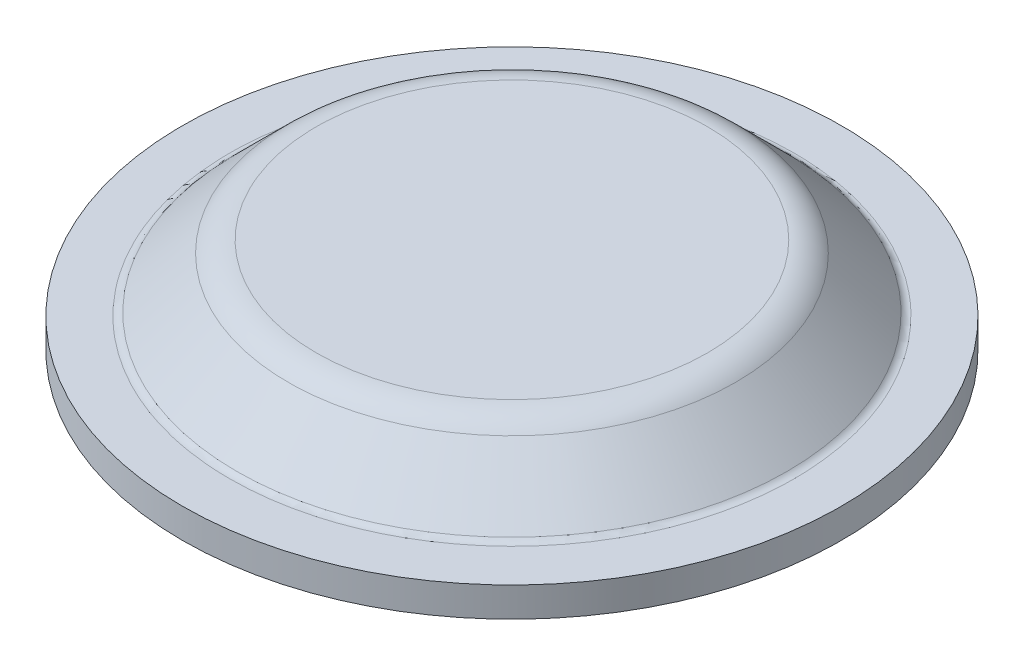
ISO-10303-21;
HEADER;
FILE_DESCRIPTION(('STEP AP214'),'2;1');
FILE_NAME('part.step','',(''),(''),'','','');
FILE_SCHEMA(('AUTOMOTIVE_DESIGN { 1 0 10303 214 1 1 1 1 }'));
ENDSEC;
DATA;
#1=APPLICATION_CONTEXT('core data for automotive mechanical design processes');
#2=APPLICATION_PROTOCOL_DEFINITION('international standard','automotive_design',2000,#1);
#3=PRODUCT_CONTEXT('',#1,'mechanical');
#4=PRODUCT('Part','Part','',(#3));
#5=PRODUCT_RELATED_PRODUCT_CATEGORY('part','',(#4));
#6=PRODUCT_DEFINITION_FORMATION('','',#4);
#7=PRODUCT_DEFINITION_CONTEXT('part definition',#1,'design');
#8=PRODUCT_DEFINITION('design','',#6,#7);
#9=PRODUCT_DEFINITION_SHAPE('','',#8);
#10=(LENGTH_UNIT() NAMED_UNIT(*) SI_UNIT(.MILLI.,.METRE.));
#11=(NAMED_UNIT(*) PLANE_ANGLE_UNIT() SI_UNIT($,.RADIAN.));
#12=(NAMED_UNIT(*) SI_UNIT($,.STERADIAN.) SOLID_ANGLE_UNIT());
#13=UNCERTAINTY_MEASURE_WITH_UNIT(LENGTH_MEASURE(1.E-05),#10,'distance_accuracy_value','');
#14=(GEOMETRIC_REPRESENTATION_CONTEXT(3) GLOBAL_UNCERTAINTY_ASSIGNED_CONTEXT((#13)) GLOBAL_UNIT_ASSIGNED_CONTEXT((#10,
#11,#12)) REPRESENTATION_CONTEXT('',''));
#15=CARTESIAN_POINT('',(0.,0.,0.));
#16=DIRECTION('',(0.,0.,1.));
#17=DIRECTION('',(1.,0.,0.));
#18=AXIS2_PLACEMENT_3D('',#15,#16,#17);
#19=CARTESIAN_POINT('',(0.,-2.286,0.));
#20=DIRECTION('',(0.,1.,0.));
#21=DIRECTION('',(0.,0.,1.));
#22=AXIS2_PLACEMENT_3D('',#19,#20,#21);
#23=PLANE('',#22);
#24=CARTESIAN_POINT('',(0.,-2.286,0.));
#25=DIRECTION('',(0.,1.,0.));
#26=DIRECTION('',(0.,0.,1.));
#27=AXIS2_PLACEMENT_3D('',#24,#25,#26);
#28=CIRCLE('',#27,15.0876);
#29=CARTESIAN_POINT('',(0.,-2.286,15.0876));
#30=VERTEX_POINT('',#29);
#31=EDGE_CURVE('E22',#30,#30,#28,.F.);
#32=ORIENTED_EDGE('',*,*,#31,.T.);
#33=EDGE_LOOP('',(#32));
#34=FACE_BOUND('',#33,.T.);
#35=ADVANCED_FACE('F17',(#34),#23,.F.);
#36=CARTESIAN_POINT('',(0.,-3.048,0.));
#37=DIRECTION('',(0.,1.,0.));
#38=DIRECTION('',(0.,0.,1.));
#39=AXIS2_PLACEMENT_3D('',#36,#37,#38);
#40=TOROIDAL_SURFACE('',#39,15.0876,0.761999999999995);
#41=ORIENTED_EDGE('',*,*,#31,.F.);
#42=EDGE_LOOP('',(#41));
#43=FACE_BOUND('',#42,.T.);
#44=CARTESIAN_POINT('',(0.,-2.50918463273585,0.));
#45=DIRECTION('',(0.,-1.,0.));
#46=DIRECTION('',(1.,0.,0.));
#47=AXIS2_PLACEMENT_3D('',#44,#45,#46);
#48=CIRCLE('',#47,15.6264153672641);
#49=CARTESIAN_POINT('',(15.6264153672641,-2.50918463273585,0.));
#50=VERTEX_POINT('',#49);
#51=EDGE_CURVE('E125',#50,#50,#48,.T.);
#52=ORIENTED_EDGE('',*,*,#51,.T.);
#53=EDGE_LOOP('',(#52));
#54=FACE_BOUND('',#53,.T.);
#55=ADVANCED_FACE('F85',(#43,#54),#40,.F.);
#56=CARTESIAN_POINT('',(0.,-6.47326146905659,0.));
#57=DIRECTION('',(0.,-1.,0.));
#58=DIRECTION('',(1.,0.,0.));
#59=AXIS2_PLACEMENT_3D('',#56,#57,#58);
#60=CONICAL_SURFACE('',#59,19.5904922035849,0.785398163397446);
#61=ORIENTED_EDGE('',*,*,#51,.F.);
#62=EDGE_LOOP('',(#61));
#63=FACE_BOUND('',#62,.T.);
#64=CARTESIAN_POINT('',(0.,-6.47326146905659,0.));
#65=DIRECTION('',(0.,1.,0.));
#66=DIRECTION('',(0.,0.,-1.));
#67=AXIS2_PLACEMENT_3D('',#64,#65,#66);
#68=CIRCLE('',#67,19.5904922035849);
#69=CARTESIAN_POINT('',(0.,-6.47326146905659,-19.5904922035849));
#70=VERTEX_POINT('',#69);
#71=EDGE_CURVE('E121',#70,#70,#68,.T.);
#72=ORIENTED_EDGE('',*,*,#71,.F.);
#73=EDGE_LOOP('',(#72));
#74=FACE_BOUND('',#73,.T.);
#75=ADVANCED_FACE('F82',(#63,#74),#60,.F.);
#76=CARTESIAN_POINT('',(0.,-4.31799999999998,0.));
#77=DIRECTION('',(0.,1.,0.));
#78=DIRECTION('',(0.,0.,1.));
#79=AXIS2_PLACEMENT_3D('',#76,#77,#78);
#80=TOROIDAL_SURFACE('',#79,21.7457536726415,3.04800000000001);
#81=ORIENTED_EDGE('',*,*,#71,.T.);
#82=EDGE_LOOP('',(#81));
#83=FACE_BOUND('',#82,.T.);
#84=CARTESIAN_POINT('',(0.,-7.366,0.));
#85=DIRECTION('',(0.,1.,0.));
#86=DIRECTION('',(0.,0.,1.));
#87=AXIS2_PLACEMENT_3D('',#84,#85,#86);
#88=CIRCLE('',#87,21.7457536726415);
#89=CARTESIAN_POINT('',(0.,-7.366,21.7457536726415));
#90=VERTEX_POINT('',#89);
#91=EDGE_CURVE('E119',#90,#90,#88,.F.);
#92=ORIENTED_EDGE('',*,*,#91,.T.);
#93=EDGE_LOOP('',(#92));
#94=FACE_BOUND('',#93,.T.);
#95=ADVANCED_FACE('F80',(#83,#94),#80,.T.);
#96=CARTESIAN_POINT('',(21.7457536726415,-7.366,0.));
#97=DIRECTION('',(0.,1.,0.));
#98=DIRECTION('',(0.,0.,1.));
#99=AXIS2_PLACEMENT_3D('',#96,#97,#98);
#100=PLANE('',#99);
#101=CARTESIAN_POINT('',(0.,-7.366,0.));
#102=DIRECTION('',(0.,1.,0.));
#103=DIRECTION('',(0.,0.,1.));
#104=AXIS2_PLACEMENT_3D('',#101,#102,#103);
#105=CIRCLE('',#104,25.4);
#106=CARTESIAN_POINT('',(0.,-7.366,25.4));
#107=VERTEX_POINT('',#106);
#108=EDGE_CURVE('E117',#107,#107,#105,.T.);
#109=ORIENTED_EDGE('',*,*,#108,.F.);
#110=EDGE_LOOP('',(#109));
#111=FACE_BOUND('',#110,.T.);
#112=ORIENTED_EDGE('',*,*,#91,.F.);
#113=EDGE_LOOP('',(#112));
#114=FACE_BOUND('',#113,.T.);
#115=ADVANCED_FACE('F76',(#111,#114),#100,.F.);
#116=CARTESIAN_POINT('',(0.,-7.36753318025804,0.));
#117=DIRECTION('',(0.,1.,0.));
#118=DIRECTION('',(0.,0.,1.));
#119=AXIS2_PLACEMENT_3D('',#116,#117,#118);
#120=CYLINDRICAL_SURFACE('',#119,25.4);
#121=ORIENTED_EDGE('',*,*,#108,.T.);
#122=EDGE_LOOP('',(#121));
#123=FACE_BOUND('',#122,.T.);
#124=CARTESIAN_POINT('',(0.,-5.08,0.));
#125=DIRECTION('',(0.,1.,0.));
#126=DIRECTION('',(0.,0.,1.));
#127=AXIS2_PLACEMENT_3D('',#124,#125,#126);
#128=CIRCLE('',#127,25.4);
#129=CARTESIAN_POINT('',(0.,-5.08,25.4));
#130=VERTEX_POINT('',#129);
#131=EDGE_CURVE('E47',#130,#130,#128,.F.);
#132=ORIENTED_EDGE('',*,*,#131,.T.);
#133=EDGE_LOOP('',(#132));
#134=FACE_BOUND('',#133,.T.);
#135=ADVANCED_FACE('F69',(#123,#134),#120,.T.);
#136=CARTESIAN_POINT('',(21.7457536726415,-5.08,0.));
#137=DIRECTION('',(0.,-1.,0.));
#138=DIRECTION('',(0.,0.,-1.));
#139=AXIS2_PLACEMENT_3D('',#136,#137,#138);
#140=PLANE('',#139);
#141=ORIENTED_EDGE('',*,*,#131,.F.);
#142=EDGE_LOOP('',(#141));
#143=FACE_BOUND('',#142,.T.);
#144=CARTESIAN_POINT('',(0.,-5.08,21.7457536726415));
#145=CARTESIAN_POINT('',(1.44941344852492,-5.08,21.7457536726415));
#146=CARTESIAN_POINT('',(2.88660446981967,-5.08,21.5533133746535));
#147=CARTESIAN_POINT('',(4.51263775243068,-5.08,21.3355870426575));
#148=CARTESIAN_POINT('',(6.08881102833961,-5.08,20.8759235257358));
#149=CARTESIAN_POINT('',(7.86493299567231,-5.08,20.3579484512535));
#150=CARTESIAN_POINT('',(9.52903812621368,-5.08,19.5467448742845));
#151=CARTESIAN_POINT('',(11.3901999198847,-5.08,18.639481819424));
#152=CARTESIAN_POINT('',(13.0474522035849,-5.08,17.3966029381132));
#153=CARTESIAN_POINT('',(14.8782923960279,-5.08,16.0235394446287));
#154=CARTESIAN_POINT('',(16.383787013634,-5.08,14.2985777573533));
#155=CARTESIAN_POINT('',(18.0176176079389,-5.08,12.4265716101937));
#156=CARTESIAN_POINT('',(19.1874297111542,-5.08,10.2332958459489));
#157=CARTESIAN_POINT('',(20.4276411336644,-5.08,7.90802869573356));
#158=CARTESIAN_POINT('',(21.0766535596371,-5.08,5.35280090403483));
#159=CARTESIAN_POINT('',(21.745686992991,-5.08,2.71874837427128));
#160=CARTESIAN_POINT('',(21.7457536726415,-5.08,0.));
#161=CARTESIAN_POINT('',(21.7458203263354,-5.08,-2.71769004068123));
#162=CARTESIAN_POINT('',(21.0766535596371,-5.08,-5.35280090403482));
#163=CARTESIAN_POINT('',(20.4280172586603,-5.08,-7.90706487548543));
#164=CARTESIAN_POINT('',(19.1874297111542,-5.08,-10.2332958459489));
#165=CARTESIAN_POINT('',(18.0182027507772,-5.08,-12.4257182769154));
#166=CARTESIAN_POINT('',(16.383787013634,-5.08,-14.2985777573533));
#167=CARTESIAN_POINT('',(14.8790547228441,-5.08,-16.0228343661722));
#168=CARTESIAN_POINT('',(13.0474522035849,-5.08,-17.3966029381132));
#169=CARTESIAN_POINT('',(11.391065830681,-5.08,-18.6389530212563));
#170=CARTESIAN_POINT('',(9.52903812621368,-5.08,-19.5467448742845));
#171=CARTESIAN_POINT('',(7.86603780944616,-5.08,-20.3575051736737));
#172=CARTESIAN_POINT('',(6.08881102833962,-5.08,-20.8759235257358));
#173=CARTESIAN_POINT('',(4.51390150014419,-5.08,-21.3353257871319));
#174=CARTESIAN_POINT('',(2.88660446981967,-5.08,-21.5533133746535));
#175=CARTESIAN_POINT('',(1.45002026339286,-5.08,-21.7457536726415));
#176=CARTESIAN_POINT('',(0.,-5.08,-21.7457536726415));
#177=B_SPLINE_CURVE_WITH_KNOTS('',2,(#144,#145,#146,#147,#148,#149,#150,#151,#152,#153,#154,
#155,#156,#157,#158,#159,#160,#161,#162,#163,#164,#165,#166,#167,#168,#169,#170,#171,#172,#173,
#174,#175,#176),.UNSPECIFIED.,.F.,.F.,(3,2,2,2,2,2,2,2,2,2,2,2,2,2,2,2,3),(0.,0.0625,0.125,
0.1875,0.25,0.3125,0.375,0.4375,0.5,0.5625,0.625,0.6875,0.75,0.8125,0.875,0.9375,1.),.UNSPECIFIED.);
#178=CARTESIAN_POINT('',(0.,-5.08,-21.7457536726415));
#179=VERTEX_POINT('',#178);
#180=CARTESIAN_POINT('',(0.,-5.08,21.7457536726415));
#181=VERTEX_POINT('',#180);
#182=EDGE_CURVE('E46',#179,#181,#177,.F.);
#183=ORIENTED_EDGE('',*,*,#182,.T.);
#184=CARTESIAN_POINT('',(0.,-5.08,-21.7457536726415));
#185=CARTESIAN_POINT('',(-1.44941344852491,-5.08,-21.7457536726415));
#186=CARTESIAN_POINT('',(-2.88660446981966,-5.08,-21.5533133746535));
#187=CARTESIAN_POINT('',(-4.51263775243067,-5.08,-21.3355870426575));
#188=CARTESIAN_POINT('',(-6.08881102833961,-5.08,-20.8759235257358));
#189=CARTESIAN_POINT('',(-7.86493299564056,-5.08,-20.3579484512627));
#190=CARTESIAN_POINT('',(-9.52903812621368,-5.08,-19.5467448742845));
#191=CARTESIAN_POINT('',(-11.3901999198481,-5.08,-18.6394818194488));
#192=CARTESIAN_POINT('',(-13.0474522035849,-5.08,-17.3966029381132));
#193=CARTESIAN_POINT('',(-14.8782923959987,-5.08,-16.0235394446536));
#194=CARTESIAN_POINT('',(-16.383787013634,-5.08,-14.2985777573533));
#195=CARTESIAN_POINT('',(-18.0176176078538,-5.08,-12.4265716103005));
#196=CARTESIAN_POINT('',(-19.1874297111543,-5.08,-10.2332958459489));
#197=CARTESIAN_POINT('',(-20.4276411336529,-5.08,-7.90802869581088));
#198=CARTESIAN_POINT('',(-21.0766535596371,-5.08,-5.35280090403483));
#199=CARTESIAN_POINT('',(-21.7456869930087,-5.08,-2.71874837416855));
#200=CARTESIAN_POINT('',(-21.7457536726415,-5.08,0.));
#201=CARTESIAN_POINT('',(-21.7458203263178,-5.08,2.71769004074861));
#202=CARTESIAN_POINT('',(-21.0766535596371,-5.08,5.35280090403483));
#203=CARTESIAN_POINT('',(-20.4280172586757,-5.08,7.90706487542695));
#204=CARTESIAN_POINT('',(-19.1874297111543,-5.08,10.2332958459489));
#205=CARTESIAN_POINT('',(-18.0182027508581,-5.08,12.4257182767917));
#206=CARTESIAN_POINT('',(-16.383787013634,-5.08,14.2985777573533));
#207=CARTESIAN_POINT('',(-14.8790547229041,-5.08,16.0228343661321));
#208=CARTESIAN_POINT('',(-13.0474522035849,-5.08,17.3966029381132));
#209=CARTESIAN_POINT('',(-11.3910658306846,-5.08,18.6389530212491));
#210=CARTESIAN_POINT('',(-9.52903812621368,-5.08,19.5467448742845));
#211=CARTESIAN_POINT('',(-7.8660378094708,-5.08,20.3575051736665));
#212=CARTESIAN_POINT('',(-6.08881102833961,-5.08,20.8759235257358));
#213=CARTESIAN_POINT('',(-4.51390150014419,-5.08,21.3353257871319));
#214=CARTESIAN_POINT('',(-2.88660446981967,-5.08,21.5533133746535));
#215=CARTESIAN_POINT('',(-1.45002026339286,-5.08,21.7457536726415));
#216=CARTESIAN_POINT('',(0.,-5.08,21.7457536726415));
#217=B_SPLINE_CURVE_WITH_KNOTS('',2,(#184,#185,#186,#187,#188,#189,#190,#191,#192,#193,#194,
#195,#196,#197,#198,#199,#200,#201,#202,#203,#204,#205,#206,#207,#208,#209,#210,#211,#212,#213,
#214,#215,#216),.UNSPECIFIED.,.F.,.F.,(3,2,2,2,2,2,2,2,2,2,2,2,2,2,2,2,3),(0.,0.0625,0.125,
0.1875,0.25,0.3125,0.375,0.4375,0.5,0.5625,0.625,0.6875,0.75,0.8125,0.875,0.9375,1.),.UNSPECIFIED.);
#218=EDGE_CURVE('E42',#181,#179,#217,.F.);
#219=ORIENTED_EDGE('',*,*,#218,.T.);
#220=EDGE_LOOP('',(#183,#219));
#221=FACE_BOUND('',#220,.T.);
#222=ADVANCED_FACE('F45',(#143,#221),#140,.F.);
#223=CARTESIAN_POINT('',(0.,-4.31799999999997,0.));
#224=DIRECTION('',(0.,1.,0.));
#225=DIRECTION('',(0.,0.,1.));
#226=AXIS2_PLACEMENT_3D('',#223,#224,#225);
#227=TOROIDAL_SURFACE('',#226,21.7457536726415,0.762000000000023);
#228=CARTESIAN_POINT('',(0.,-4.85681536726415,0.));
#229=DIRECTION('',(0.,-1.,0.));
#230=DIRECTION('',(1.,0.,0.));
#231=AXIS2_PLACEMENT_3D('',#228,#229,#230);
#232=CIRCLE('',#231,21.2069383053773);
#233=CARTESIAN_POINT('',(21.2069383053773,-4.85681536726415,0.));
#234=VERTEX_POINT('',#233);
#235=EDGE_CURVE('E50',#234,#234,#232,.F.);
#236=ORIENTED_EDGE('',*,*,#235,.F.);
#237=EDGE_LOOP('',(#236));
#238=FACE_BOUND('',#237,.T.);
#239=ORIENTED_EDGE('',*,*,#182,.F.);
#240=ORIENTED_EDGE('',*,*,#218,.F.);
#241=EDGE_LOOP('',(#239,#240));
#242=FACE_BOUND('',#241,.T.);
#243=ADVANCED_FACE('F49',(#238,#242),#227,.F.);
#244=CARTESIAN_POINT('',(0.,-4.85681536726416,0.));
#245=DIRECTION('',(0.,-1.,0.));
#246=DIRECTION('',(1.,0.,0.));
#247=AXIS2_PLACEMENT_3D('',#244,#245,#246);
#248=CONICAL_SURFACE('',#247,21.2069383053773,0.785398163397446);
#249=ORIENTED_EDGE('',*,*,#235,.T.);
#250=EDGE_LOOP('',(#249));
#251=FACE_BOUND('',#250,.T.);
#252=CARTESIAN_POINT('',(0.,-0.892738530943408,0.));
#253=DIRECTION('',(0.,1.,0.));
#254=DIRECTION('',(0.,0.,-1.));
#255=AXIS2_PLACEMENT_3D('',#252,#253,#254);
#256=CIRCLE('',#255,17.2428614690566);
#257=CARTESIAN_POINT('',(0.,-0.892738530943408,-17.2428614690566));
#258=VERTEX_POINT('',#257);
#259=EDGE_CURVE('E53',#258,#258,#256,.T.);
#260=ORIENTED_EDGE('',*,*,#259,.F.);
#261=EDGE_LOOP('',(#260));
#262=FACE_BOUND('',#261,.T.);
#263=ADVANCED_FACE('F71',(#251,#262),#248,.T.);
#264=CARTESIAN_POINT('',(0.,-3.04800000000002,0.));
#265=DIRECTION('',(0.,1.,0.));
#266=DIRECTION('',(-1.,0.,0.));
#267=AXIS2_PLACEMENT_3D('',#264,#265,#266);
#268=TOROIDAL_SURFACE('',#267,15.0876,3.04800000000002);
#269=ORIENTED_EDGE('',*,*,#259,.T.);
#270=EDGE_LOOP('',(#269));
#271=FACE_BOUND('',#270,.T.);
#272=CARTESIAN_POINT('',(0.,0.,15.0876));
#273=CARTESIAN_POINT('',(-0.219574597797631,-8.53971907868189E-09,15.0876291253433));
#274=CARTESIAN_POINT('',(-0.439129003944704,-3.72565453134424E-09,15.0828438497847));
#275=CARTESIAN_POINT('',(-0.877825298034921,2.09295135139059E-09,15.0637453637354));
#276=CARTESIAN_POINT('',(-1.09696718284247,3.0974638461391E-09,15.0494320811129));
#277=CARTESIAN_POINT('',(-1.58914330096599,-3.32602157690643E-08,15.0066223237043));
#278=CARTESIAN_POINT('',(-1.86195594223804,-8.02756870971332E-08,14.9754748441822));
#279=CARTESIAN_POINT('',(-2.23908779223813,-9.52705532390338E-08,14.921684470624));
#280=CARTESIAN_POINT('',(-2.34436257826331,-9.40083335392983E-08,14.9054996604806));
#281=CARTESIAN_POINT('',(-2.69554540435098,-7.74930761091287E-08,14.8476429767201));
#282=CARTESIAN_POINT('',(-2.94063864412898,-4.57414194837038E-08,14.800909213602));
#283=CARTESIAN_POINT('',(-3.4613770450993,-5.63101870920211E-09,14.6881709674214));
#284=CARTESIAN_POINT('',(-3.7366442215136,-1.04081326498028E-09,14.6204100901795));
#285=CARTESIAN_POINT('',(-4.08150180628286,4.93818681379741E-11,14.5252549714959));
#286=CARTESIAN_POINT('',(-4.15309062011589,1.90577398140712E-11,14.5049365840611));
#287=CARTESIAN_POINT('',(-4.35811226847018,-3.56519402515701E-11,14.4451251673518));
#288=CARTESIAN_POINT('',(-4.49116701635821,-3.19215820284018E-11,14.4043283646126));
#289=CARTESIAN_POINT('',(-4.88855113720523,-8.55170622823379E-11,14.2764258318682));
#290=CARTESIAN_POINT('',(-5.15112580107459,-2.07616539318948E-10,14.183801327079));
#291=CARTESIAN_POINT('',(-5.67073817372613,-4.14680085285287E-10,13.9841807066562));
#292=CARTESIAN_POINT('',(-5.92777587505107,-4.99644104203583E-10,13.8771845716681));
#293=CARTESIAN_POINT('',(-6.43554085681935,-6.06652404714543E-10,13.6491319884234));
#294=CARTESIAN_POINT('',(-6.68626813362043,-6.28696649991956E-10,13.5280755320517));
#295=CARTESIAN_POINT('',(-7.18064106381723,-5.90994368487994E-10,13.2722767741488));
#296=CARTESIAN_POINT('',(-7.42428671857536,-5.31247857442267E-10,13.1375344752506));
#297=CARTESIAN_POINT('',(-7.90374764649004,-3.64854859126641E-10,12.8547791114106));
#298=CARTESIAN_POINT('',(-8.13956292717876,-2.58208416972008E-10,12.7067660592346));
#299=CARTESIAN_POINT('',(-8.60265248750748,-7.64537260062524E-11,12.397910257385));
#300=CARTESIAN_POINT('',(-8.82992678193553,-1.34542258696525E-12,12.2370675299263));
#301=CARTESIAN_POINT('',(-9.18232757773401,7.7597708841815E-13,11.9727469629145));
#302=CARTESIAN_POINT('',(-9.31051837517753,-2.35051447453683E-11,11.8733262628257));
#303=CARTESIAN_POINT('',(-9.56363462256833,-4.73747829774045E-11,11.6704047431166));
#304=CARTESIAN_POINT('',(-9.68856007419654,-4.69633120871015E-11,11.5669039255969));
#305=CARTESIAN_POINT('',(-9.93501083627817,-2.48334181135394E-11,11.355931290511));
#306=CARTESIAN_POINT('',(-10.056536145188,-3.1149853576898E-12,11.2484594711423));
#307=CARTESIAN_POINT('',(-10.2960600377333,3.07856057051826E-12,11.0296573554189));
#308=CARTESIAN_POINT('',(-10.414058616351,-1.24463792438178E-11,10.918327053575));
#309=CARTESIAN_POINT('',(-10.6696468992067,-2.84953018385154E-10,10.6692790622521));
#310=CARTESIAN_POINT('',(-10.8064354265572,-5.8960046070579E-10,10.5307367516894));
#311=CARTESIAN_POINT('',(-11.0362682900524,-1.51784942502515E-09,10.2887674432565));
#312=CARTESIAN_POINT('',(-11.1306520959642,-2.02556011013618E-09,10.1866074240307));
#313=CARTESIAN_POINT('',(-11.3397955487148,-3.11215365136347E-09,9.95384918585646));
#314=CARTESIAN_POINT('',(-11.4537506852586,-3.67710115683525E-09,9.82252598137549));
#315=CARTESIAN_POINT('',(-11.6770487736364,-4.58037678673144E-09,9.55601783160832));
#316=CARTESIAN_POINT('',(-11.786391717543,-4.91870452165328E-09,9.42083287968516));
#317=CARTESIAN_POINT('',(-12.0003360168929,-5.25358219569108E-09,9.14676072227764));
#318=CARTESIAN_POINT('',(-12.104937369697,-5.25013194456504E-09,9.00787351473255));
#319=CARTESIAN_POINT('',(-12.3092728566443,-4.90888935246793E-09,8.72656399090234));
#320=CARTESIAN_POINT('',(-12.4090069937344,-4.57109721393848E-09,8.58414167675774));
#321=CARTESIAN_POINT('',(-12.6034880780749,-3.65055265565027E-09,8.29593215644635));
#322=CARTESIAN_POINT('',(-12.6982350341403,-3.06780066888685E-09,8.15014495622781));
#323=CARTESIAN_POINT('',(-12.8826304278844,-1.90270247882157E-09,7.85538139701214));
#324=CARTESIAN_POINT('',(-12.9722788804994,-1.32035627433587E-09,7.70640504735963));
#325=CARTESIAN_POINT('',(-13.1463616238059,-3.01916703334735E-10,7.40543801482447));
#326=CARTESIAN_POINT('',(-13.2307959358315,1.34177261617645E-10,7.25344734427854));
#327=CARTESIAN_POINT('',(-13.400397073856,-1.4405796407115E-10,6.93536284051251));
#328=CARTESIAN_POINT('',(-13.4851609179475,-9.4537049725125E-10,6.76905400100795));
#329=CARTESIAN_POINT('',(-13.6586946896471,9.11706588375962E-10,6.41244355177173));
#330=CARTESIAN_POINT('',(-13.7466411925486,4.01502625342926E-09,6.22174116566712));
#331=CARTESIAN_POINT('',(-13.914625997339,-7.89587843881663E-09,5.83687069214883));
#332=CARTESIAN_POINT('',(-13.9946641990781,-2.29103322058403E-08,5.64270256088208));
#333=CARTESIAN_POINT('',(-14.1054379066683,-2.78797797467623E-08,5.3567021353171));
#334=CARTESIAN_POINT('',(-14.1394877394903,-2.6981498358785E-08,5.26614113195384));
#335=CARTESIAN_POINT('',(-14.2432937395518,-2.10741481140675E-08,4.98170688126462));
#336=CARTESIAN_POINT('',(-14.3099371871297,-1.25677808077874E-08,4.78668550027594));
#337=CARTESIAN_POINT('',(-14.4292675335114,-2.86476382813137E-09,4.41262684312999));
#338=CARTESIAN_POINT('',(-14.4826781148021,-1.0535970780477E-09,4.23381960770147));
#339=CARTESIAN_POINT('',(-14.5642831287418,1.96833579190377E-11,3.94104192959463));
#340=CARTESIAN_POINT('',(-14.5944818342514,-2.18425321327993E-11,3.82762557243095));
#341=CARTESIAN_POINT('',(-14.6825535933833,4.47421032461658E-11,3.48077351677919));
#342=CARTESIAN_POINT('',(-14.7362220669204,3.55544792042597E-10,3.24625516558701));
#343=CARTESIAN_POINT('',(-14.8323103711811,-2.58620244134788E-09,2.77491889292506));
#344=CARTESIAN_POINT('',(-14.8747301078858,-5.838782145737E-09,2.53810095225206));
#345=CARTESIAN_POINT('',(-14.9225012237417,-1.49282696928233E-08,2.22912444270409));
#346=CARTESIAN_POINT('',(-14.9330154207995,-1.73625880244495E-08,2.15774032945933));
#347=CARTESIAN_POINT('',(-14.953034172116,-2.5443703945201E-08,2.01482887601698));
#348=CARTESIAN_POINT('',(-14.9625387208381,-3.10905191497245E-08,1.94330153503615));
#349=CARTESIAN_POINT('',(-14.9845849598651,-3.74428386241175E-08,1.76732867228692));
#350=CARTESIAN_POINT('',(-14.9965244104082,-3.47015474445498E-08,1.66280783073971));
#351=CARTESIAN_POINT('',(-15.0286842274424,-2.46651780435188E-08,1.35235065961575));
#352=CARTESIAN_POINT('',(-15.0457482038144,-1.55299181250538E-08,1.146079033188));
#353=CARTESIAN_POINT('',(-15.0704829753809,-4.15757806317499E-09,0.74735416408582));
#354=CARTESIAN_POINT('',(-15.0787236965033,-1.48558227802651E-09,0.554935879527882));
#355=CARTESIAN_POINT('',(-15.0861751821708,9.20427599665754E-11,0.241646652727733));
#356=CARTESIAN_POINT('',(-15.0876061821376,2.99047281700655E-11,0.12082426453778));
#357=CARTESIAN_POINT('',(-15.0875922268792,-3.76125059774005E-11,-0.15191858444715));
#358=CARTESIAN_POINT('',(-15.0853123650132,-2.42693389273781E-11,-0.303840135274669));
#359=CARTESIAN_POINT('',(-15.0761528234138,-5.76529943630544E-11,-0.607543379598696));
#360=CARTESIAN_POINT('',(-15.0692731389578,-1.04379878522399E-10,-0.759325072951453));
#361=CARTESIAN_POINT('',(-15.0509356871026,-2.105566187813E-10,-1.06261205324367));
#362=CARTESIAN_POINT('',(-15.039477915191,-2.7000648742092E-10,-1.21411733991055));
#363=CARTESIAN_POINT('',(-15.0119905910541,-4.10528200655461E-10,-1.51671272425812));
#364=CARTESIAN_POINT('',(-14.9959610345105,-4.91600065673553E-10,-1.6678028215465));
#365=CARTESIAN_POINT('',(-14.959345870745,-6.69354159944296E-10,-1.96943008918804));
#366=CARTESIAN_POINT('',(-14.9387602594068,-7.66036403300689E-10,-2.11996725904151));
#367=CARTESIAN_POINT('',(-14.8930514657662,-9.73154074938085E-10,-2.42035125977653));
#368=CARTESIAN_POINT('',(-14.8679282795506,-1.08358951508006E-09,-2.57019809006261));
#369=CARTESIAN_POINT('',(-14.8131673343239,-1.31540304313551E-09,-2.86906467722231));
#370=CARTESIAN_POINT('',(-14.7835295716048,-1.43678114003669E-09,-3.0180844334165));
#371=CARTESIAN_POINT('',(-14.7197664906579,-1.68808477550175E-09,-3.31516087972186));
#372=CARTESIAN_POINT('',(-14.6856411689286,-1.81801032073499E-09,-3.46321756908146));
#373=CARTESIAN_POINT('',(-14.6129341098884,-2.08406201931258E-09,-3.75823277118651));
#374=CARTESIAN_POINT('',(-14.5743523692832,-2.22018817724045E-09,-3.90519128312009));
#375=CARTESIAN_POINT('',(-14.4927676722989,-2.49644091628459E-09,-4.19787602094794));
#376=CARTESIAN_POINT('',(-14.4497647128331,-2.63656750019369E-09,-4.34360224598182));
#377=CARTESIAN_POINT('',(-14.3593768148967,-2.91874140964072E-09,-4.63368942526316));
#378=CARTESIAN_POINT('',(-14.3119918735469,-3.06078873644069E-09,-4.77805037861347));
#379=CARTESIAN_POINT('',(-14.2128832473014,-3.34485212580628E-09,-5.06527527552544));
#380=CARTESIAN_POINT('',(-14.1611595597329,-3.4868681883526E-09,-5.20813921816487));
#381=CARTESIAN_POINT('',(-14.053420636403,-3.7690421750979E-09,-5.49223972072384));
#382=CARTESIAN_POINT('',(-13.997405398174,-3.90920009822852E-09,-5.63347627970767));
#383=CARTESIAN_POINT('',(-13.8811344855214,-4.18595733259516E-09,-5.91419312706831));
#384=CARTESIAN_POINT('',(-13.8208788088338,-4.32255664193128E-09,-6.05367341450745));
#385=CARTESIAN_POINT('',(-13.6961820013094,-4.59062177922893E-09,-6.33075043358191));
#386=CARTESIAN_POINT('',(-13.63174086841,-4.72208760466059E-09,-6.46834716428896));
#387=CARTESIAN_POINT('',(-13.4987319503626,-4.97843755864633E-09,-6.74153150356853));
#388=CARTESIAN_POINT('',(-13.4301641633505,-5.10332168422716E-09,-6.87711911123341));
#389=CARTESIAN_POINT('',(-13.2889645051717,-5.34518500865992E-09,-7.14616147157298));
#390=CARTESIAN_POINT('',(-13.216332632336,-5.46216420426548E-09,-7.27961622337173));
#391=CARTESIAN_POINT('',(-13.0670710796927,-5.68702157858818E-09,-7.54427108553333));
#392=CARTESIAN_POINT('',(-12.9904413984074,-5.7948997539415E-09,-7.67547119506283));
#393=CARTESIAN_POINT('',(-12.8332541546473,-6.00048352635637E-09,-7.93549704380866));
#394=CARTESIAN_POINT('',(-12.752696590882,-6.09818912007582E-09,-8.0643227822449));
#395=CARTESIAN_POINT('',(-12.5877270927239,-6.28248378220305E-09,-8.31948232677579));
#396=CARTESIAN_POINT('',(-12.5033151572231,-6.36907284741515E-09,-8.44581613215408));
#397=CARTESIAN_POINT('',(-12.3307139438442,-6.5303153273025E-09,-8.69587652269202));
#398=CARTESIAN_POINT('',(-12.2425246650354,-6.60496873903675E-09,-8.81960310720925));
#399=CARTESIAN_POINT('',(-12.0624492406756,-6.74164675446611E-09,-9.06433614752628));
#400=CARTESIAN_POINT('',(-11.9705630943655,-6.80367135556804E-09,-9.18534260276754));
#401=CARTESIAN_POINT('',(-11.7831777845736,-6.91452537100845E-09,-9.42452495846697));
#402=CARTESIAN_POINT('',(-11.6876786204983,-6.96335478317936E-09,-9.54270085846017));
#403=CARTESIAN_POINT('',(-11.493154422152,-7.04737703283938E-09,-9.77611426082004));
#404=CARTESIAN_POINT('',(-11.3941293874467,-7.08256986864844E-09,-9.89135176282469));
#405=CARTESIAN_POINT('',(-11.1926438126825,-7.13900457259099E-09,-10.1187832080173));
#406=CARTESIAN_POINT('',(-11.0901832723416,-7.16024643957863E-09,-10.2309771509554));
#407=CARTESIAN_POINT('',(-10.8819201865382,-7.18858991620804E-09,-10.4522190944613));
#408=CARTESIAN_POINT('',(-10.7761176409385,-7.19569152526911E-09,-10.5612670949));
#409=CARTESIAN_POINT('',(-10.5612670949,-7.19569152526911E-09,-10.7761176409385));
#410=CARTESIAN_POINT('',(-10.4522190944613,-7.18858991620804E-09,-10.8819201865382));
#411=CARTESIAN_POINT('',(-10.2309771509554,-7.16024643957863E-09,-11.0901832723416));
#412=CARTESIAN_POINT('',(-10.1187832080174,-7.13900457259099E-09,-11.1926438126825));
#413=CARTESIAN_POINT('',(-9.8913517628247,-7.08256986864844E-09,-11.3941293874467));
#414=CARTESIAN_POINT('',(-9.77611426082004,-7.04737703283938E-09,-11.493154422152));
#415=CARTESIAN_POINT('',(-9.54270085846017,-6.96335478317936E-09,-11.6876786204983));
#416=CARTESIAN_POINT('',(-9.42452495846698,-6.91452537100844E-09,-11.7831777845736));
#417=CARTESIAN_POINT('',(-9.18534260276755,-6.80367135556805E-09,-11.9705630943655));
#418=CARTESIAN_POINT('',(-9.06433614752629,-6.74164675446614E-09,-12.0624492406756));
#419=CARTESIAN_POINT('',(-8.81960310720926,-6.60496873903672E-09,-12.2425246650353));
#420=CARTESIAN_POINT('',(-8.69587652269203,-6.53031532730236E-09,-12.3307139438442));
#421=CARTESIAN_POINT('',(-8.44581613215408,-6.36907284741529E-09,-12.5033151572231));
#422=CARTESIAN_POINT('',(-8.3194823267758,-6.28248378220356E-09,-12.5877270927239));
#423=CARTESIAN_POINT('',(-8.06432278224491,-6.0981891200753E-09,-12.752696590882));
#424=CARTESIAN_POINT('',(-7.93549704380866,-6.00048352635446E-09,-12.8332541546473));
#425=CARTESIAN_POINT('',(-7.67547119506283,-5.7948997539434E-09,-12.9904413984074));
#426=CARTESIAN_POINT('',(-7.54427108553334,-5.68702157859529E-09,-13.0670710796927));
#427=CARTESIAN_POINT('',(-7.27961622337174,-5.46216420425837E-09,-13.216332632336));
#428=CARTESIAN_POINT('',(-7.14616147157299,-5.34518500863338E-09,-13.2889645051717));
#429=CARTESIAN_POINT('',(-6.87711911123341,-5.1033216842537E-09,-13.4301641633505));
#430=CARTESIAN_POINT('',(-6.74153150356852,-4.97843755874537E-09,-13.4987319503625));
#431=CARTESIAN_POINT('',(-6.46834716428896,-4.72208760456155E-09,-13.63174086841));
#432=CARTESIAN_POINT('',(-6.33075043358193,-4.59062177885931E-09,-13.6961820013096));
#433=CARTESIAN_POINT('',(-6.05367341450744,-4.3225566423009E-09,-13.8208788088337));
#434=CARTESIAN_POINT('',(-5.91419312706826,-4.18595733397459E-09,-13.8811344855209));
#435=CARTESIAN_POINT('',(-5.63347627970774,-3.90920009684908E-09,-13.9974053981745));
#436=CARTESIAN_POINT('',(-5.49223972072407,-3.76904216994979E-09,-14.0534206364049));
#437=CARTESIAN_POINT('',(-5.20813921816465,-3.4868681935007E-09,-14.161159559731));
#438=CARTESIAN_POINT('',(-5.06527527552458,-3.34485214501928E-09,-14.2128832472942));
#439=CARTESIAN_POINT('',(-4.77805037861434,-3.0607887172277E-09,-14.311991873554));
#440=CARTESIAN_POINT('',(-4.63368942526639,-2.91874133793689E-09,-14.3593768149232));
#441=CARTESIAN_POINT('',(-4.3436022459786,-2.63656757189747E-09,-14.4497647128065));
#442=CARTESIAN_POINT('',(-4.19787602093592,-2.49644118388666E-09,-14.4927676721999));
#443=CARTESIAN_POINT('',(-3.90519128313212,-2.22018790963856E-09,-14.5743523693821));
#444=CARTESIAN_POINT('',(-3.75823277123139,-2.08406102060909E-09,-14.6129341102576));
#445=CARTESIAN_POINT('',(-3.4632175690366,-1.81801131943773E-09,-14.6856411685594));
#446=CARTESIAN_POINT('',(-3.31516087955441,-1.68808850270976E-09,-14.71976648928));
#447=CARTESIAN_POINT('',(-3.01808443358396,-1.43677741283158E-09,-14.7835295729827));
#448=CARTESIAN_POINT('',(-2.86906467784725,-1.31538913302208E-09,-14.8131673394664));
#449=CARTESIAN_POINT('',(-2.57019808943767,-1.08360342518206E-09,-14.8679282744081));
#450=CARTESIAN_POINT('',(-2.42035125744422,-9.73205988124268E-10,-14.893051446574));
#451=CARTESIAN_POINT('',(-2.11996726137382,-7.65984490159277E-10,-14.9387602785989));
#452=CARTESIAN_POINT('',(-1.96943009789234,-6.69160417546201E-10,-14.959345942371));
#453=CARTESIAN_POINT('',(-1.66780281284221,-4.91793807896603E-10,-14.9959609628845));
#454=CARTESIAN_POINT('',(-1.51671269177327,-4.11251256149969E-10,-15.0119903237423));
#455=CARTESIAN_POINT('',(-1.21411737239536,-2.69283432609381E-10,-15.0394781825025));
#456=CARTESIAN_POINT('',(-1.06261217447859,-2.07858142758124E-10,-15.0509366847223));
#457=CARTESIAN_POINT('',(-0.759324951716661,-1.07078351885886E-10,-15.0692721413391));
#458=CARTESIAN_POINT('',(-0.607542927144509,-6.77238291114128E-11,-15.0761491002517));
#459=CARTESIAN_POINT('',(-0.303840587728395,-1.41985145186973E-11,-15.0853160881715));
#460=CARTESIAN_POINT('',(-0.151920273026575,0.,-15.0876061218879));
#461=CARTESIAN_POINT('',(0.,0.,-15.0876));
#462=B_SPLINE_CURVE_WITH_KNOTS('',3,(#272,#273,#274,#275,#276,#277,#278,#279,#280,#281,#282,
#283,#284,#285,#286,#287,#288,#289,#290,#291,#292,#293,#294,#295,#296,#297,#298,#299,#300,#301,
#302,#303,#304,#305,#306,#307,#308,#309,#310,#311,#312,#313,#314,#315,#316,#317,#318,#319,#320,
#321,#322,#323,#324,#325,#326,#327,#328,#329,#330,#331,#332,#333,#334,#335,#336,#337,#338,#339,
#340,#341,#342,#343,#344,#345,#346,#347,#348,#349,#350,#351,#352,#353,#354,#355,#356,#357,#358,
#359,#360,#361,#362,#363,#364,#365,#366,#367,#368,#369,#370,#371,#372,#373,#374,#375,#376,#377,
#378,#379,#380,#381,#382,#383,#384,#385,#386,#387,#388,#389,#390,#391,#392,#393,#394,#395,#396,
#397,#398,#399,#400,#401,#402,#403,#404,#405,#406,#407,#408,#409,#410,#411,#412,#413,#414,#415,
#416,#417,#418,#419,#420,#421,#422,#423,#424,#425,#426,#427,#428,#429,#430,#431,#432,#433,#434,
#435,#436,#437,#438,#439,#440,#441,#442,#443,#444,#445,#446,#447,#448,#449,#450,#451,#452,#453,
#454,#455,#456,#457,#458,#459,#460,#461),.UNSPECIFIED.,.F.,.F.,(4,2,2,2,2,2,2,2,2,2,2,2,2,2,2,2,
2,2,2,2,2,2,2,2,2,2,2,2,2,2,2,2,2,2,2,2,2,2,2,2,2,2,2,2,2,2,2,2,2,2,2,2,2,2,2,2,2,2,2,2,2,2,2,2,
2,2,2,2,2,2,2,2,2,2,2,2,2,2,2,2,2,2,2,2,2,2,2,2,2,2,2,2,2,2,4),(0.,0.658631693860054,
1.31726837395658,2.14054424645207,2.46006455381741,3.20826520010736,4.05821702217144,
4.28146230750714,4.69891964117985,5.53375561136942,6.36859270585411,7.20343028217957,
8.03826769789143,8.87310431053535,9.70793947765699,10.1945449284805,10.6811501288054,
11.1677555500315,11.6543616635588,12.2382794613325,12.6554916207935,13.176998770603,
13.6985068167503,14.2200151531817,14.7415231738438,15.263030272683,15.7845358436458,
16.306039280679,16.8659038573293,17.4957433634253,18.1255908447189,18.4158305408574,
19.0339189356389,19.5936291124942,19.9457088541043,20.6671625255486,21.3886222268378,
21.605080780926,21.821540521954,22.1371211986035,22.7578595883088,23.3354988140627,
23.6979618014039,24.1537052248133,24.6094491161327,25.0651934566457,25.520938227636,
25.9766834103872,26.4324289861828,26.8881749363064,27.3439212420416,27.7996678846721,
28.2554148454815,28.7111621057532,29.166909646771,29.6226574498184,30.0784054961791,
30.5341537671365,30.9899022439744,31.4456509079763,31.9013997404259,32.3571487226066,
32.8128978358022,33.2686470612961,33.7243963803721,34.1801457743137,34.6358952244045,
35.0916447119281,35.5473942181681,36.0031437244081,36.4588932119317,36.9146426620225,
37.370392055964,37.82614137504,38.281890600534,38.7376397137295,39.1933886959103,
39.6491375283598,40.1048861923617,40.5606346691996,41.0163829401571,41.4721309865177,
41.9278787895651,42.3836263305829,42.8393735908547,43.295120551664,43.7508671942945,
44.2066135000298,44.6623594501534,45.118105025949,45.5738502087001,46.0295949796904,
46.4853393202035,46.9410832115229,47.3968266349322),.UNSPECIFIED.);
#463=CARTESIAN_POINT('',(0.,0.,15.0876));
#464=VERTEX_POINT('',#463);
#465=CARTESIAN_POINT('',(0.,0.,-15.0876));
#466=VERTEX_POINT('',#465);
#467=EDGE_CURVE('E10',#464,#466,#462,.T.);
#468=ORIENTED_EDGE('',*,*,#467,.T.);
#469=CARTESIAN_POINT('',(0.,0.,0.));
#470=DIRECTION('',(0.,1.,0.));
#471=DIRECTION('',(-1.,0.,0.));
#472=AXIS2_PLACEMENT_3D('',#469,#470,#471);
#473=CIRCLE('',#472,15.0876);
#474=EDGE_CURVE('E28',#466,#464,#473,.F.);
#475=ORIENTED_EDGE('',*,*,#474,.T.);
#476=EDGE_LOOP('',(#468,#475));
#477=FACE_BOUND('',#476,.T.);
#478=ADVANCED_FACE('F19',(#271,#477),#268,.T.);
#479=CARTESIAN_POINT('',(0.,0.,0.));
#480=DIRECTION('',(0.,-1.,0.));
#481=DIRECTION('',(0.,0.,-1.));
#482=AXIS2_PLACEMENT_3D('',#479,#480,#481);
#483=PLANE('',#482);
#484=ORIENTED_EDGE('',*,*,#474,.F.);
#485=ORIENTED_EDGE('',*,*,#467,.F.);
#486=EDGE_LOOP('',(#484,#485));
#487=FACE_BOUND('',#486,.T.);
#488=ADVANCED_FACE('F103',(#487),#483,.F.);
#489=CLOSED_SHELL('',(#35,#55,#75,#95,#115,#135,#222,#243,#263,#478,#488));
#490=MANIFOLD_SOLID_BREP('B1',#489);
#491=ADVANCED_BREP_SHAPE_REPRESENTATION('',(#18,#490),#14);
#492=SHAPE_DEFINITION_REPRESENTATION(#9,#491);
ENDSEC;
END-ISO-10303-21;
